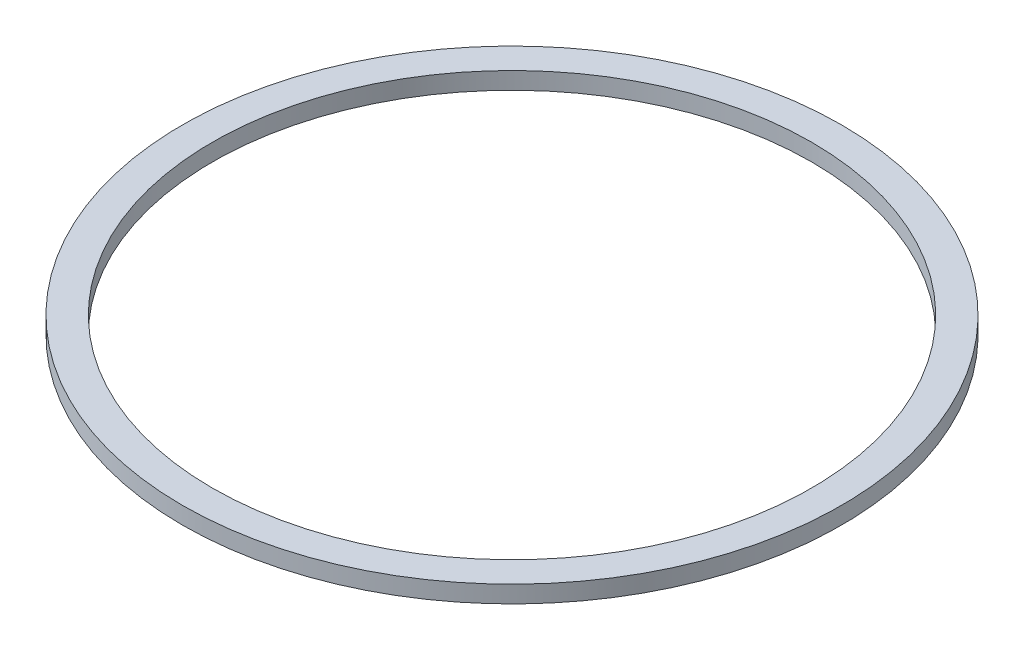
ISO-10303-21;
HEADER;
FILE_DESCRIPTION(('STEP AP214'),'2;1');
FILE_NAME('part.step','',(''),(''),'','','');
FILE_SCHEMA(('AUTOMOTIVE_DESIGN { 1 0 10303 214 1 1 1 1 }'));
ENDSEC;
DATA;
#1=APPLICATION_CONTEXT('core data for automotive mechanical design processes');
#2=APPLICATION_PROTOCOL_DEFINITION('international standard','automotive_design',2000,#1);
#3=PRODUCT_CONTEXT('',#1,'mechanical');
#4=PRODUCT('Part','Part','',(#3));
#5=PRODUCT_RELATED_PRODUCT_CATEGORY('part','',(#4));
#6=PRODUCT_DEFINITION_FORMATION('','',#4);
#7=PRODUCT_DEFINITION_CONTEXT('part definition',#1,'design');
#8=PRODUCT_DEFINITION('design','',#6,#7);
#9=PRODUCT_DEFINITION_SHAPE('','',#8);
#10=(LENGTH_UNIT() NAMED_UNIT(*) SI_UNIT(.MILLI.,.METRE.));
#11=(NAMED_UNIT(*) PLANE_ANGLE_UNIT() SI_UNIT($,.RADIAN.));
#12=(NAMED_UNIT(*) SI_UNIT($,.STERADIAN.) SOLID_ANGLE_UNIT());
#13=UNCERTAINTY_MEASURE_WITH_UNIT(LENGTH_MEASURE(1.E-05),#10,'distance_accuracy_value','');
#14=(GEOMETRIC_REPRESENTATION_CONTEXT(3) GLOBAL_UNCERTAINTY_ASSIGNED_CONTEXT((#13)) GLOBAL_UNIT_ASSIGNED_CONTEXT((#10,
#11,#12)) REPRESENTATION_CONTEXT('',''));
#15=CARTESIAN_POINT('',(0.,0.,0.));
#16=DIRECTION('',(0.,0.,1.));
#17=DIRECTION('',(1.,0.,0.));
#18=AXIS2_PLACEMENT_3D('',#15,#16,#17);
#19=CARTESIAN_POINT('',(0.,1.,0.));
#20=DIRECTION('',(0.,1.,0.));
#21=DIRECTION('',(0.,0.,1.));
#22=AXIS2_PLACEMENT_3D('',#19,#20,#21);
#23=PLANE('',#22);
#24=CARTESIAN_POINT('',(0.,1.,0.));
#25=DIRECTION('',(0.,1.,0.));
#26=DIRECTION('',(0.,0.,1.));
#27=AXIS2_PLACEMENT_3D('',#24,#25,#26);
#28=CIRCLE('',#27,19.25);
#29=CARTESIAN_POINT('',(0.,1.,19.25));
#30=VERTEX_POINT('',#29);
#31=EDGE_CURVE('E10',#30,#30,#28,.T.);
#32=ORIENTED_EDGE('',*,*,#31,.T.);
#33=EDGE_LOOP('',(#32));
#34=FACE_BOUND('',#33,.T.);
#35=CARTESIAN_POINT('',(0.,1.,0.));
#36=DIRECTION('',(0.,1.,0.));
#37=DIRECTION('',(0.,0.,1.));
#38=AXIS2_PLACEMENT_3D('',#35,#36,#37);
#39=CIRCLE('',#38,17.5);
#40=CARTESIAN_POINT('',(0.,1.,17.5));
#41=VERTEX_POINT('',#40);
#42=EDGE_CURVE('E43',#41,#41,#39,.T.);
#43=ORIENTED_EDGE('',*,*,#42,.F.);
#44=EDGE_LOOP('',(#43));
#45=FACE_BOUND('',#44,.T.);
#46=ADVANCED_FACE('F32',(#34,#45),#23,.T.);
#47=CARTESIAN_POINT('',(0.,0.,0.));
#48=DIRECTION('',(0.,1.,0.));
#49=DIRECTION('',(0.,0.,1.));
#50=AXIS2_PLACEMENT_3D('',#47,#48,#49);
#51=PLANE('',#50);
#52=CARTESIAN_POINT('',(0.,0.,0.));
#53=DIRECTION('',(0.,1.,0.));
#54=DIRECTION('',(0.,0.,1.));
#55=AXIS2_PLACEMENT_3D('',#52,#53,#54);
#56=CIRCLE('',#55,19.25);
#57=CARTESIAN_POINT('',(0.,0.,19.25));
#58=VERTEX_POINT('',#57);
#59=EDGE_CURVE('E36',#58,#58,#56,.T.);
#60=ORIENTED_EDGE('',*,*,#59,.F.);
#61=EDGE_LOOP('',(#60));
#62=FACE_BOUND('',#61,.T.);
#63=CARTESIAN_POINT('',(0.,0.,0.));
#64=DIRECTION('',(0.,1.,0.));
#65=DIRECTION('',(0.,0.,1.));
#66=AXIS2_PLACEMENT_3D('',#63,#64,#65);
#67=CIRCLE('',#66,17.5);
#68=CARTESIAN_POINT('',(0.,0.,17.5));
#69=VERTEX_POINT('',#68);
#70=EDGE_CURVE('E45',#69,#69,#67,.T.);
#71=ORIENTED_EDGE('',*,*,#70,.T.);
#72=EDGE_LOOP('',(#71));
#73=FACE_BOUND('',#72,.T.);
#74=ADVANCED_FACE('F55',(#62,#73),#51,.F.);
#75=CARTESIAN_POINT('',(0.,1.,0.));
#76=DIRECTION('',(0.,-1.,0.));
#77=DIRECTION('',(0.,0.,-1.));
#78=AXIS2_PLACEMENT_3D('',#75,#76,#77);
#79=CYLINDRICAL_SURFACE('',#78,19.25);
#80=ORIENTED_EDGE('',*,*,#31,.F.);
#81=EDGE_LOOP('',(#80));
#82=FACE_BOUND('',#81,.T.);
#83=ORIENTED_EDGE('',*,*,#59,.T.);
#84=EDGE_LOOP('',(#83));
#85=FACE_BOUND('',#84,.T.);
#86=ADVANCED_FACE('F34',(#82,#85),#79,.T.);
#87=CARTESIAN_POINT('',(0.,1.,0.));
#88=DIRECTION('',(0.,-1.,0.));
#89=DIRECTION('',(0.,0.,-1.));
#90=AXIS2_PLACEMENT_3D('',#87,#88,#89);
#91=CYLINDRICAL_SURFACE('',#90,17.5);
#92=ORIENTED_EDGE('',*,*,#42,.T.);
#93=EDGE_LOOP('',(#92));
#94=FACE_BOUND('',#93,.T.);
#95=ORIENTED_EDGE('',*,*,#70,.F.);
#96=EDGE_LOOP('',(#95));
#97=FACE_BOUND('',#96,.T.);
#98=ADVANCED_FACE('F51',(#94,#97),#91,.F.);
#99=CLOSED_SHELL('',(#46,#74,#86,#98));
#100=MANIFOLD_SOLID_BREP('B2',#99);
#101=ADVANCED_BREP_SHAPE_REPRESENTATION('',(#18,#100),#14);
#102=SHAPE_DEFINITION_REPRESENTATION(#9,#101);
ENDSEC;
END-ISO-10303-21;
